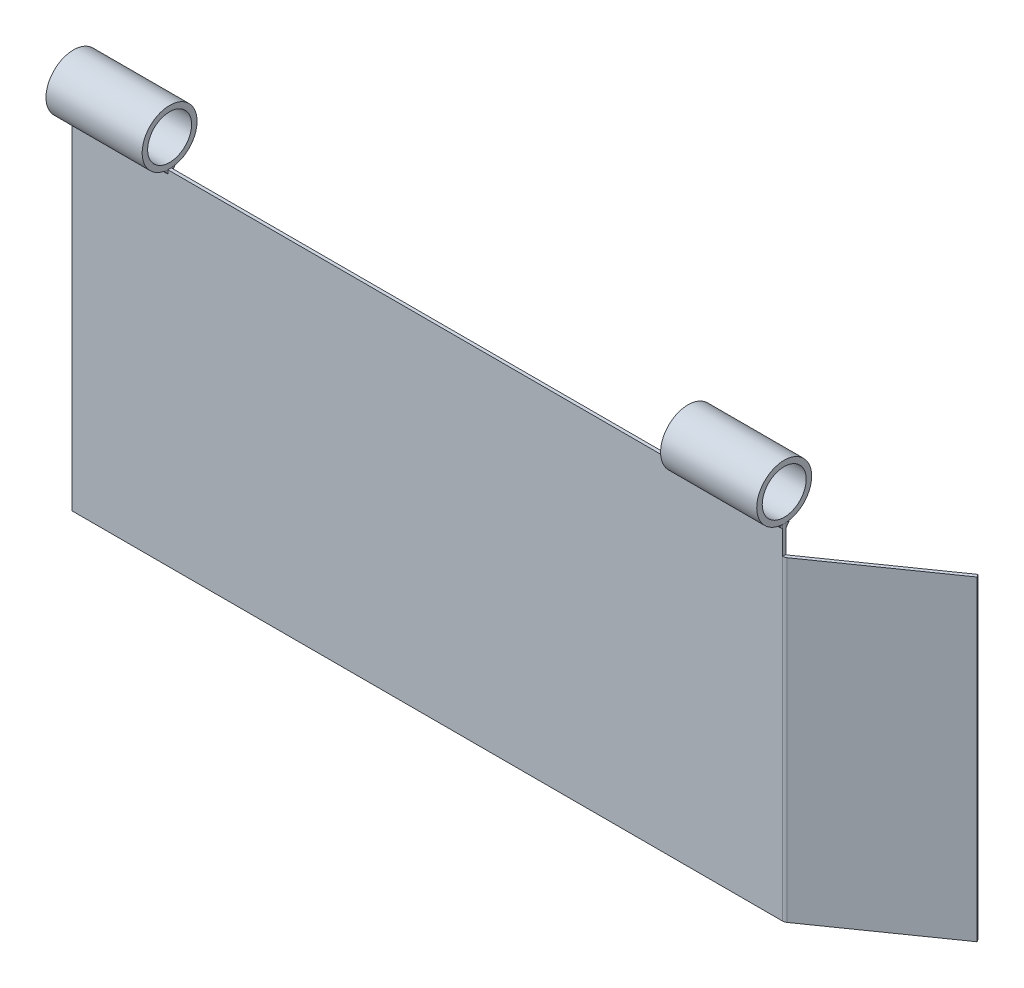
ISO-10303-21;
HEADER;
FILE_DESCRIPTION(('STEP AP214'),'2;1');
FILE_NAME('part.step','',(''),(''),'','','');
FILE_SCHEMA(('AUTOMOTIVE_DESIGN { 1 0 10303 214 1 1 1 1 }'));
ENDSEC;
DATA;
#1=APPLICATION_CONTEXT('core data for automotive mechanical design processes');
#2=APPLICATION_PROTOCOL_DEFINITION('international standard','automotive_design',2000,#1);
#3=PRODUCT_CONTEXT('',#1,'mechanical');
#4=PRODUCT('Part','Part','',(#3));
#5=PRODUCT_RELATED_PRODUCT_CATEGORY('part','',(#4));
#6=PRODUCT_DEFINITION_FORMATION('','',#4);
#7=PRODUCT_DEFINITION_CONTEXT('part definition',#1,'design');
#8=PRODUCT_DEFINITION('design','',#6,#7);
#9=PRODUCT_DEFINITION_SHAPE('','',#8);
#10=(LENGTH_UNIT() NAMED_UNIT(*) SI_UNIT(.MILLI.,.METRE.));
#11=(NAMED_UNIT(*) PLANE_ANGLE_UNIT() SI_UNIT($,.RADIAN.));
#12=(NAMED_UNIT(*) SI_UNIT($,.STERADIAN.) SOLID_ANGLE_UNIT());
#13=UNCERTAINTY_MEASURE_WITH_UNIT(LENGTH_MEASURE(1.E-05),#10,'distance_accuracy_value','');
#14=(GEOMETRIC_REPRESENTATION_CONTEXT(3) GLOBAL_UNCERTAINTY_ASSIGNED_CONTEXT((#13)) GLOBAL_UNIT_ASSIGNED_CONTEXT((#10,
#11,#12)) REPRESENTATION_CONTEXT('',''));
#15=CARTESIAN_POINT('',(0.,0.,0.));
#16=DIRECTION('',(0.,0.,1.));
#17=DIRECTION('',(1.,0.,0.));
#18=AXIS2_PLACEMENT_3D('',#15,#16,#17);
#19=CARTESIAN_POINT('',(-149.9987999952,-135.,-0.6));
#20=DIRECTION('',(0.,0.,1.));
#21=DIRECTION('',(1.,0.,0.));
#22=AXIS2_PLACEMENT_3D('',#19,#20,#21);
#23=PLANE('',#22);
#24=DIRECTION('',(0.,1.,0.));
#25=VECTOR('',#24,1.);
#26=CARTESIAN_POINT('',(-114.9987999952,-135.,-0.6));
#27=LINE('',#26,#25);
#28=CARTESIAN_POINT('',(-114.9987999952,-11.7932447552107,-0.6));
#29=VERTEX_POINT('',#28);
#30=CARTESIAN_POINT('',(-114.9987999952,-10.,-0.6));
#31=VERTEX_POINT('',#30);
#32=EDGE_CURVE('E110',#29,#31,#27,.T.);
#33=ORIENTED_EDGE('',*,*,#32,.T.);
#34=DIRECTION('',(-1.,0.,0.));
#35=VECTOR('',#34,1.);
#36=CARTESIAN_POINT('',(-149.9987999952,-10.,-0.6));
#37=LINE('',#36,#35);
#38=CARTESIAN_POINT('',(-149.9987999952,-10.,-0.6));
#39=VERTEX_POINT('',#38);
#40=EDGE_CURVE('E101',#31,#39,#37,.T.);
#41=ORIENTED_EDGE('',*,*,#40,.T.);
#42=DIRECTION('',(0.,1.,0.));
#43=VECTOR('',#42,1.);
#44=CARTESIAN_POINT('',(-149.9987999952,-135.,-0.6));
#45=LINE('',#44,#43);
#46=CARTESIAN_POINT('',(-149.9987999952,-11.7932447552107,-0.6));
#47=VERTEX_POINT('',#46);
#48=EDGE_CURVE('E114',#47,#39,#45,.T.);
#49=ORIENTED_EDGE('',*,*,#48,.F.);
#50=DIRECTION('',(1.,0.,0.));
#51=VECTOR('',#50,1.);
#52=CARTESIAN_POINT('',(-149.9987999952,-11.7932447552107,-0.6));
#53=LINE('',#52,#51);
#54=EDGE_CURVE('E52',#47,#29,#53,.T.);
#55=ORIENTED_EDGE('',*,*,#54,.T.);
#56=EDGE_LOOP('',(#33,#41,#49,#55));
#57=FACE_BOUND('',#56,.T.);
#58=ADVANCED_FACE('F49',(#57),#23,.T.);
#59=CARTESIAN_POINT('',(-114.9987999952,-8.,0.));
#60=DIRECTION('',(1.,0.,0.));
#61=DIRECTION('',(0.,0.,-1.));
#62=AXIS2_PLACEMENT_3D('',#59,#60,#61);
#63=PLANE('',#62);
#64=CARTESIAN_POINT('',(-114.9987999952,0.,0.));
#65=DIRECTION('',(1.,0.,0.));
#66=DIRECTION('',(0.,0.,-1.));
#67=AXIS2_PLACEMENT_3D('',#64,#65,#66);
#68=CIRCLE('',#67,10.);
#69=CARTESIAN_POINT('',(-114.9987999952,-9.80245261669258,-1.97785810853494));
#70=VERTEX_POINT('',#69);
#71=CARTESIAN_POINT('',(-114.9987999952,-10.,0.));
#72=VERTEX_POINT('',#71);
#73=EDGE_CURVE('E87',#70,#72,#68,.F.);
#74=ORIENTED_EDGE('',*,*,#73,.T.);
#75=DIRECTION('',(0.,0.,1.));
#76=VECTOR('',#75,1.);
#77=CARTESIAN_POINT('',(-114.9987999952,-10.,0.));
#78=LINE('',#77,#76);
#79=EDGE_CURVE('E58',#31,#72,#78,.T.);
#80=ORIENTED_EDGE('',*,*,#79,.F.);
#81=ORIENTED_EDGE('',*,*,#32,.F.);
#82=DIRECTION('',(0.,0.822266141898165,-0.569103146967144));
#83=VECTOR('',#82,1.);
#84=CARTESIAN_POINT('',(-114.9987999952,-9.80245261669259,-1.97785810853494));
#85=LINE('',#84,#83);
#86=EDGE_CURVE('E66',#29,#70,#85,.T.);
#87=ORIENTED_EDGE('',*,*,#86,.T.);
#88=EDGE_LOOP('',(#74,#80,#81,#87));
#89=FACE_BOUND('',#88,.T.);
#90=ADVANCED_FACE('F89',(#89),#63,.T.);
#91=CARTESIAN_POINT('',(-220.065090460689,-9.80245261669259,-1.97785810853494));
#92=DIRECTION('',(0.,0.569103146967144,0.822266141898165));
#93=DIRECTION('',(0.,-0.822266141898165,0.569103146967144));
#94=AXIS2_PLACEMENT_3D('',#91,#92,#93);
#95=PLANE('',#94);
#96=ORIENTED_EDGE('',*,*,#86,.F.);
#97=ORIENTED_EDGE('',*,*,#54,.F.);
#98=DIRECTION('',(0.,-0.822266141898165,0.569103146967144));
#99=VECTOR('',#98,1.);
#100=CARTESIAN_POINT('',(-149.9987999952,-9.80245261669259,-1.97785810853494));
#101=LINE('',#100,#99);
#102=CARTESIAN_POINT('',(-149.9987999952,-9.80245261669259,-1.97785810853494));
#103=VERTEX_POINT('',#102);
#104=EDGE_CURVE('E118',#103,#47,#101,.T.);
#105=ORIENTED_EDGE('',*,*,#104,.F.);
#106=DIRECTION('',(-1.,0.,0.));
#107=VECTOR('',#106,1.);
#108=CARTESIAN_POINT('',(-220.065090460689,-9.80245261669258,-1.97785810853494));
#109=LINE('',#108,#107);
#110=EDGE_CURVE('E106',#70,#103,#109,.T.);
#111=ORIENTED_EDGE('',*,*,#110,.F.);
#112=EDGE_LOOP('',(#96,#97,#105,#111));
#113=FACE_BOUND('',#112,.T.);
#114=ADVANCED_FACE('F117',(#113),#95,.F.);
#115=CARTESIAN_POINT('',(-149.9987999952,-8.,0.));
#116=DIRECTION('',(-1.,0.,0.));
#117=DIRECTION('',(0.,0.,1.));
#118=AXIS2_PLACEMENT_3D('',#115,#116,#117);
#119=PLANE('',#118);
#120=CARTESIAN_POINT('',(-149.9987999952,0.,0.));
#121=DIRECTION('',(-1.,0.,0.));
#122=DIRECTION('',(0.,0.,1.));
#123=AXIS2_PLACEMENT_3D('',#120,#121,#122);
#124=CIRCLE('',#123,10.);
#125=CARTESIAN_POINT('',(-149.9987999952,-10.,0.));
#126=VERTEX_POINT('',#125);
#127=EDGE_CURVE('E104',#103,#126,#124,.T.);
#128=ORIENTED_EDGE('',*,*,#127,.F.);
#129=ORIENTED_EDGE('',*,*,#104,.T.);
#130=ORIENTED_EDGE('',*,*,#48,.T.);
#131=DIRECTION('',(0.,0.,-1.));
#132=VECTOR('',#131,1.);
#133=CARTESIAN_POINT('',(-149.9987999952,-10.,0.601));
#134=LINE('',#133,#132);
#135=EDGE_CURVE('E13',#126,#39,#134,.T.);
#136=ORIENTED_EDGE('',*,*,#135,.F.);
#137=EDGE_LOOP('',(#128,#129,#130,#136));
#138=FACE_BOUND('',#137,.T.);
#139=ADVANCED_FACE('F123',(#138),#119,.T.);
#140=CARTESIAN_POINT('',(-220.065090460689,0.,0.));
#141=DIRECTION('',(-1.,0.,0.));
#142=DIRECTION('',(0.,0.,1.));
#143=AXIS2_PLACEMENT_3D('',#140,#141,#142);
#144=CYLINDRICAL_SURFACE('',#143,10.);
#145=ORIENTED_EDGE('',*,*,#110,.T.);
#146=ORIENTED_EDGE('',*,*,#127,.T.);
#147=DIRECTION('',(-1.,0.,0.));
#148=VECTOR('',#147,1.);
#149=CARTESIAN_POINT('',(-220.065090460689,-10.,0.));
#150=LINE('',#149,#148);
#151=EDGE_CURVE('E98',#126,#72,#150,.F.);
#152=ORIENTED_EDGE('',*,*,#151,.T.);
#153=ORIENTED_EDGE('',*,*,#73,.F.);
#154=EDGE_LOOP('',(#145,#146,#152,#153));
#155=FACE_BOUND('',#154,.T.);
#156=ADVANCED_FACE('F103',(#155),#144,.F.);
#157=CARTESIAN_POINT('',(108.728299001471,-10.,0.601));
#158=DIRECTION('',(0.,1.,0.));
#159=DIRECTION('',(-1.,0.,0.));
#160=AXIS2_PLACEMENT_3D('',#157,#158,#159);
#161=PLANE('',#160);
#162=ORIENTED_EDGE('',*,*,#79,.T.);
#163=ORIENTED_EDGE('',*,*,#151,.F.);
#164=ORIENTED_EDGE('',*,*,#135,.T.);
#165=ORIENTED_EDGE('',*,*,#40,.F.);
#166=EDGE_LOOP('',(#162,#163,#164,#165));
#167=FACE_BOUND('',#166,.T.);
#168=ADVANCED_FACE('F97',(#167),#161,.F.);
#169=CLOSED_SHELL('',(#58,#90,#114,#139,#156,#168));
#170=MANIFOLD_SOLID_BREP('B2',#169);
#171=CARTESIAN_POINT('',(-149.9987999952,-135.,0.6));
#172=DIRECTION('',(0.,0.,1.));
#173=DIRECTION('',(1.,0.,0.));
#174=AXIS2_PLACEMENT_3D('',#171,#172,#173);
#175=PLANE('',#174);
#176=DIRECTION('',(1.,0.,0.));
#177=VECTOR('',#176,1.);
#178=CARTESIAN_POINT('',(108.728299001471,-10.,0.6));
#179=LINE('',#178,#177);
#180=CARTESIAN_POINT('',(-149.9987999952,-10.,0.6));
#181=VERTEX_POINT('',#180);
#182=CARTESIAN_POINT('',(-114.9987999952,-10.,0.6));
#183=VERTEX_POINT('',#182);
#184=EDGE_CURVE('E260',#181,#183,#179,.T.);
#185=ORIENTED_EDGE('',*,*,#184,.T.);
#186=DIRECTION('',(0.,1.,0.));
#187=VECTOR('',#186,1.);
#188=CARTESIAN_POINT('',(-114.9987999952,-135.,0.6));
#189=LINE('',#188,#187);
#190=CARTESIAN_POINT('',(-114.9987999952,-11.3835825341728,0.6));
#191=VERTEX_POINT('',#190);
#192=EDGE_CURVE('E47',#191,#183,#189,.T.);
#193=ORIENTED_EDGE('',*,*,#192,.F.);
#194=DIRECTION('',(-1.,0.,0.));
#195=VECTOR('',#194,1.);
#196=CARTESIAN_POINT('',(-149.9987999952,-11.3835825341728,0.6));
#197=LINE('',#196,#195);
#198=CARTESIAN_POINT('',(-149.9987999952,-11.3835825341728,0.6));
#199=VERTEX_POINT('',#198);
#200=EDGE_CURVE('E194',#191,#199,#197,.T.);
#201=ORIENTED_EDGE('',*,*,#200,.T.);
#202=DIRECTION('',(0.,1.,0.));
#203=VECTOR('',#202,1.);
#204=CARTESIAN_POINT('',(-149.9987999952,-8.,0.6));
#205=LINE('',#204,#203);
#206=EDGE_CURVE('E242',#199,#181,#205,.T.);
#207=ORIENTED_EDGE('',*,*,#206,.T.);
#208=EDGE_LOOP('',(#185,#193,#201,#207));
#209=FACE_BOUND('',#208,.T.);
#210=ADVANCED_FACE('F191',(#209),#175,.F.);
#211=CARTESIAN_POINT('',(-114.9987999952,-8.,0.));
#212=DIRECTION('',(1.,0.,0.));
#213=DIRECTION('',(0.,0.,-1.));
#214=AXIS2_PLACEMENT_3D('',#211,#212,#213);
#215=PLANE('',#214);
#216=DIRECTION('',(0.,-0.771089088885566,-0.63672727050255));
#217=VECTOR('',#216,1.);
#218=CARTESIAN_POINT('',(-114.9987999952,-11.3835825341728,0.6));
#219=LINE('',#218,#217);
#220=CARTESIAN_POINT('',(-114.9987999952,-9.81946901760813,1.89156765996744));
#221=VERTEX_POINT('',#220);
#222=EDGE_CURVE('E245',#221,#191,#219,.T.);
#223=ORIENTED_EDGE('',*,*,#222,.T.);
#224=ORIENTED_EDGE('',*,*,#192,.T.);
#225=DIRECTION('',(0.,0.,1.));
#226=VECTOR('',#225,1.);
#227=CARTESIAN_POINT('',(-114.9987999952,-10.,0.));
#228=LINE('',#227,#226);
#229=CARTESIAN_POINT('',(-114.9987999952,-10.,0.));
#230=VERTEX_POINT('',#229);
#231=EDGE_CURVE('E248',#230,#183,#228,.T.);
#232=ORIENTED_EDGE('',*,*,#231,.F.);
#233=CARTESIAN_POINT('',(-114.9987999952,0.,0.));
#234=DIRECTION('',(1.,0.,0.));
#235=DIRECTION('',(0.,0.,-1.));
#236=AXIS2_PLACEMENT_3D('',#233,#234,#235);
#237=CIRCLE('',#236,10.);
#238=EDGE_CURVE('E255',#230,#221,#237,.F.);
#239=ORIENTED_EDGE('',*,*,#238,.T.);
#240=EDGE_LOOP('',(#223,#224,#232,#239));
#241=FACE_BOUND('',#240,.T.);
#242=ADVANCED_FACE('F265',(#241),#215,.T.);
#243=CARTESIAN_POINT('',(-220.065090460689,-11.3835825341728,0.6));
#244=DIRECTION('',(0.,0.63672727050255,-0.771089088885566));
#245=DIRECTION('',(0.,0.771089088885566,0.63672727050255));
#246=AXIS2_PLACEMENT_3D('',#243,#244,#245);
#247=PLANE('',#246);
#248=ORIENTED_EDGE('',*,*,#200,.F.);
#249=ORIENTED_EDGE('',*,*,#222,.F.);
#250=DIRECTION('',(-1.,0.,0.));
#251=VECTOR('',#250,1.);
#252=CARTESIAN_POINT('',(-220.065090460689,-9.81946901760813,1.89156765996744));
#253=LINE('',#252,#251);
#254=CARTESIAN_POINT('',(-149.9987999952,-9.81946901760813,1.89156765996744));
#255=VERTEX_POINT('',#254);
#256=EDGE_CURVE('E231',#255,#221,#253,.F.);
#257=ORIENTED_EDGE('',*,*,#256,.F.);
#258=DIRECTION('',(0.,0.771089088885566,0.63672727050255));
#259=VECTOR('',#258,1.);
#260=CARTESIAN_POINT('',(-149.9987999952,-11.3835825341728,0.6));
#261=LINE('',#260,#259);
#262=EDGE_CURVE('E237',#199,#255,#261,.T.);
#263=ORIENTED_EDGE('',*,*,#262,.F.);
#264=EDGE_LOOP('',(#248,#249,#257,#263));
#265=FACE_BOUND('',#264,.T.);
#266=ADVANCED_FACE('F247',(#265),#247,.F.);
#267=CARTESIAN_POINT('',(-149.9987999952,-8.,0.));
#268=DIRECTION('',(-1.,0.,0.));
#269=DIRECTION('',(0.,0.,1.));
#270=AXIS2_PLACEMENT_3D('',#267,#268,#269);
#271=PLANE('',#270);
#272=ORIENTED_EDGE('',*,*,#262,.T.);
#273=CARTESIAN_POINT('',(-149.9987999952,0.,0.));
#274=DIRECTION('',(-1.,0.,0.));
#275=DIRECTION('',(0.,0.,1.));
#276=AXIS2_PLACEMENT_3D('',#273,#274,#275);
#277=CIRCLE('',#276,10.);
#278=CARTESIAN_POINT('',(-149.9987999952,-10.,0.));
#279=VERTEX_POINT('',#278);
#280=EDGE_CURVE('E227',#255,#279,#277,.F.);
#281=ORIENTED_EDGE('',*,*,#280,.T.);
#282=DIRECTION('',(0.,0.,-1.));
#283=VECTOR('',#282,1.);
#284=CARTESIAN_POINT('',(-149.9987999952,-10.,0.601));
#285=LINE('',#284,#283);
#286=EDGE_CURVE('E251',#181,#279,#285,.T.);
#287=ORIENTED_EDGE('',*,*,#286,.F.);
#288=ORIENTED_EDGE('',*,*,#206,.F.);
#289=EDGE_LOOP('',(#272,#281,#287,#288));
#290=FACE_BOUND('',#289,.T.);
#291=ADVANCED_FACE('F241',(#290),#271,.T.);
#292=CARTESIAN_POINT('',(-220.065090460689,0.,0.));
#293=DIRECTION('',(-1.,0.,0.));
#294=DIRECTION('',(0.,0.,1.));
#295=AXIS2_PLACEMENT_3D('',#292,#293,#294);
#296=CYLINDRICAL_SURFACE('',#295,10.);
#297=ORIENTED_EDGE('',*,*,#238,.F.);
#298=DIRECTION('',(-1.,0.,0.));
#299=VECTOR('',#298,1.);
#300=CARTESIAN_POINT('',(-220.065090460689,-10.,0.));
#301=LINE('',#300,#299);
#302=EDGE_CURVE('E200',#279,#230,#301,.F.);
#303=ORIENTED_EDGE('',*,*,#302,.F.);
#304=ORIENTED_EDGE('',*,*,#280,.F.);
#305=ORIENTED_EDGE('',*,*,#256,.T.);
#306=EDGE_LOOP('',(#297,#303,#304,#305));
#307=FACE_BOUND('',#306,.T.);
#308=ADVANCED_FACE('F229',(#307),#296,.F.);
#309=CARTESIAN_POINT('',(108.728299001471,-10.,0.601));
#310=DIRECTION('',(0.,1.,0.));
#311=DIRECTION('',(-1.,0.,0.));
#312=AXIS2_PLACEMENT_3D('',#309,#310,#311);
#313=PLANE('',#312);
#314=ORIENTED_EDGE('',*,*,#231,.T.);
#315=ORIENTED_EDGE('',*,*,#184,.F.);
#316=ORIENTED_EDGE('',*,*,#286,.T.);
#317=ORIENTED_EDGE('',*,*,#302,.T.);
#318=EDGE_LOOP('',(#314,#315,#316,#317));
#319=FACE_BOUND('',#318,.T.);
#320=ADVANCED_FACE('F264',(#319),#313,.F.);
#321=CLOSED_SHELL('',(#210,#242,#266,#291,#308,#320));
#322=MANIFOLD_SOLID_BREP('B7',#321);
#323=CARTESIAN_POINT('',(108.728299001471,-20.,0.601));
#324=DIRECTION('',(1.,0.,0.));
#325=DIRECTION('',(0.,0.,-1.));
#326=AXIS2_PLACEMENT_3D('',#323,#324,#325);
#327=PLANE('',#326);
#328=DIRECTION('',(0.,0.,-1.));
#329=VECTOR('',#328,1.);
#330=CARTESIAN_POINT('',(108.728299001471,-10.,0.601));
#331=LINE('',#330,#329);
#332=CARTESIAN_POINT('',(108.728299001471,-10.,-0.6));
#333=VERTEX_POINT('',#332);
#334=CARTESIAN_POINT('',(108.728299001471,-10.,-1.84113250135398));
#335=VERTEX_POINT('',#334);
#336=EDGE_CURVE('E355',#333,#335,#331,.T.);
#337=ORIENTED_EDGE('',*,*,#336,.F.);
#338=DIRECTION('',(0.,1.,0.));
#339=VECTOR('',#338,1.);
#340=CARTESIAN_POINT('',(108.728299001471,-135.,-0.6));
#341=LINE('',#340,#339);
#342=CARTESIAN_POINT('',(108.728299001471,-11.7932447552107,-0.6));
#343=VERTEX_POINT('',#342);
#344=EDGE_CURVE('E386',#343,#333,#341,.T.);
#345=ORIENTED_EDGE('',*,*,#344,.F.);
#346=DIRECTION('',(0.,0.822266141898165,-0.569103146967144));
#347=VECTOR('',#346,1.);
#348=CARTESIAN_POINT('',(108.728299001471,-9.80245261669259,-1.97785810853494));
#349=LINE('',#348,#347);
#350=EDGE_CURVE('E380',#343,#335,#349,.T.);
#351=ORIENTED_EDGE('',*,*,#350,.T.);
#352=EDGE_LOOP('',(#337,#345,#351));
#353=FACE_BOUND('',#352,.T.);
#354=ADVANCED_FACE('F333',(#353),#327,.T.);
#355=CARTESIAN_POINT('',(-220.065090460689,-9.80245261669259,-1.97785810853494));
#356=DIRECTION('',(0.,0.569103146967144,0.822266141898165));
#357=DIRECTION('',(0.,-0.822266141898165,0.569103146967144));
#358=AXIS2_PLACEMENT_3D('',#355,#356,#357);
#359=PLANE('',#358);
#360=DIRECTION('',(1.,0.,0.));
#361=VECTOR('',#360,1.);
#362=CARTESIAN_POINT('',(-149.9987999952,-11.7932447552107,-0.6));
#363=LINE('',#362,#361);
#364=CARTESIAN_POINT('',(73.7282990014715,-11.7932447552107,-0.6));
#365=VERTEX_POINT('',#364);
#366=EDGE_CURVE('E375',#365,#343,#363,.T.);
#367=ORIENTED_EDGE('',*,*,#366,.F.);
#368=DIRECTION('',(0.,0.822266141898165,-0.569103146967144));
#369=VECTOR('',#368,1.);
#370=CARTESIAN_POINT('',(73.7282990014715,-9.80245261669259,-1.97785810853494));
#371=LINE('',#370,#369);
#372=CARTESIAN_POINT('',(73.7282990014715,-10.,-1.84113250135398));
#373=VERTEX_POINT('',#372);
#374=EDGE_CURVE('E189',#365,#373,#371,.T.);
#375=ORIENTED_EDGE('',*,*,#374,.T.);
#376=DIRECTION('',(-1.,0.,0.));
#377=VECTOR('',#376,1.);
#378=CARTESIAN_POINT('',(-220.065090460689,-10.,-1.84113250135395));
#379=LINE('',#378,#377);
#380=EDGE_CURVE('E341',#335,#373,#379,.T.);
#381=ORIENTED_EDGE('',*,*,#380,.F.);
#382=ORIENTED_EDGE('',*,*,#350,.F.);
#383=EDGE_LOOP('',(#367,#375,#381,#382));
#384=FACE_BOUND('',#383,.T.);
#385=ADVANCED_FACE('F335',(#384),#359,.F.);
#386=CARTESIAN_POINT('',(108.728299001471,-10.,0.601));
#387=DIRECTION('',(0.,1.,0.));
#388=DIRECTION('',(-1.,0.,0.));
#389=AXIS2_PLACEMENT_3D('',#386,#387,#388);
#390=PLANE('',#389);
#391=DIRECTION('',(0.,0.,-1.));
#392=VECTOR('',#391,1.);
#393=CARTESIAN_POINT('',(73.7282990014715,-10.,0.601));
#394=LINE('',#393,#392);
#395=CARTESIAN_POINT('',(73.7282990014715,-10.,-0.6));
#396=VERTEX_POINT('',#395);
#397=EDGE_CURVE('E348',#396,#373,#394,.T.);
#398=ORIENTED_EDGE('',*,*,#397,.F.);
#399=DIRECTION('',(-1.,0.,0.));
#400=VECTOR('',#399,1.);
#401=CARTESIAN_POINT('',(-149.9987999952,-10.,-0.6));
#402=LINE('',#401,#400);
#403=EDGE_CURVE('E377',#333,#396,#402,.T.);
#404=ORIENTED_EDGE('',*,*,#403,.F.);
#405=ORIENTED_EDGE('',*,*,#336,.T.);
#406=ORIENTED_EDGE('',*,*,#380,.T.);
#407=EDGE_LOOP('',(#398,#404,#405,#406));
#408=FACE_BOUND('',#407,.T.);
#409=ADVANCED_FACE('F385',(#408),#390,.T.);
#410=CARTESIAN_POINT('',(-149.9987999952,-135.,-0.6));
#411=DIRECTION('',(0.,0.,1.));
#412=DIRECTION('',(1.,0.,0.));
#413=AXIS2_PLACEMENT_3D('',#410,#411,#412);
#414=PLANE('',#413);
#415=DIRECTION('',(0.,1.,0.));
#416=VECTOR('',#415,1.);
#417=CARTESIAN_POINT('',(73.7282990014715,-135.,-0.6));
#418=LINE('',#417,#416);
#419=EDGE_CURVE('E368',#365,#396,#418,.T.);
#420=ORIENTED_EDGE('',*,*,#419,.F.);
#421=ORIENTED_EDGE('',*,*,#366,.T.);
#422=ORIENTED_EDGE('',*,*,#344,.T.);
#423=ORIENTED_EDGE('',*,*,#403,.T.);
#424=EDGE_LOOP('',(#420,#421,#422,#423));
#425=FACE_BOUND('',#424,.T.);
#426=ADVANCED_FACE('F374',(#425),#414,.T.);
#427=CARTESIAN_POINT('',(73.7282990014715,-135.,-13.8826637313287));
#428=DIRECTION('',(1.,0.,0.));
#429=DIRECTION('',(0.,0.,-1.));
#430=AXIS2_PLACEMENT_3D('',#427,#428,#429);
#431=PLANE('',#430);
#432=ORIENTED_EDGE('',*,*,#397,.T.);
#433=ORIENTED_EDGE('',*,*,#374,.F.);
#434=ORIENTED_EDGE('',*,*,#419,.T.);
#435=EDGE_LOOP('',(#432,#433,#434));
#436=FACE_BOUND('',#435,.T.);
#437=ADVANCED_FACE('F367',(#436),#431,.F.);
#438=CLOSED_SHELL('',(#354,#385,#409,#426,#437));
#439=MANIFOLD_SOLID_BREP('B41',#438);
#440=CARTESIAN_POINT('',(108.728299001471,-20.,0.601));
#441=DIRECTION('',(1.,0.,0.));
#442=DIRECTION('',(0.,0.,-1.));
#443=AXIS2_PLACEMENT_3D('',#440,#441,#442);
#444=PLANE('',#443);
#445=DIRECTION('',(0.,1.,0.));
#446=VECTOR('',#445,1.);
#447=CARTESIAN_POINT('',(108.728299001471,-20.,0.599999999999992));
#448=LINE('',#447,#446);
#449=CARTESIAN_POINT('',(108.728299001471,-11.3835825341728,0.599999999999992));
#450=VERTEX_POINT('',#449);
#451=CARTESIAN_POINT('',(108.728299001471,-10.,0.599999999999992));
#452=VERTEX_POINT('',#451);
#453=EDGE_CURVE('E485',#450,#452,#448,.T.);
#454=ORIENTED_EDGE('',*,*,#453,.T.);
#455=DIRECTION('',(0.,0.,-1.));
#456=VECTOR('',#455,1.);
#457=CARTESIAN_POINT('',(108.728299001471,-10.,0.601));
#458=LINE('',#457,#456);
#459=CARTESIAN_POINT('',(108.728299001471,-10.,1.74249409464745));
#460=VERTEX_POINT('',#459);
#461=EDGE_CURVE('E484',#460,#452,#458,.T.);
#462=ORIENTED_EDGE('',*,*,#461,.F.);
#463=DIRECTION('',(0.,-0.771089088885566,-0.63672727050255));
#464=VECTOR('',#463,1.);
#465=CARTESIAN_POINT('',(108.728299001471,-11.3835825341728,0.6));
#466=LINE('',#465,#464);
#467=EDGE_CURVE('E446',#460,#450,#466,.T.);
#468=ORIENTED_EDGE('',*,*,#467,.T.);
#469=EDGE_LOOP('',(#454,#462,#468));
#470=FACE_BOUND('',#469,.T.);
#471=ADVANCED_FACE('F438',(#470),#444,.T.);
#472=CARTESIAN_POINT('',(-220.065090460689,-11.3835825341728,0.6));
#473=DIRECTION('',(0.,0.63672727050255,-0.771089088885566));
#474=DIRECTION('',(0.,0.771089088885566,0.63672727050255));
#475=AXIS2_PLACEMENT_3D('',#472,#473,#474);
#476=PLANE('',#475);
#477=DIRECTION('',(1.,0.,0.));
#478=VECTOR('',#477,1.);
#479=CARTESIAN_POINT('',(-220.065090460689,-10.,1.74249409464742));
#480=LINE('',#479,#478);
#481=CARTESIAN_POINT('',(73.7282990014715,-10.,1.74249409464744));
#482=VERTEX_POINT('',#481);
#483=EDGE_CURVE('E460',#482,#460,#480,.T.);
#484=ORIENTED_EDGE('',*,*,#483,.F.);
#485=DIRECTION('',(0.,-0.771089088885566,-0.63672727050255));
#486=VECTOR('',#485,1.);
#487=CARTESIAN_POINT('',(73.7282990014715,-11.3835825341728,0.6));
#488=LINE('',#487,#486);
#489=CARTESIAN_POINT('',(73.7282990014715,-11.3835825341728,0.6));
#490=VERTEX_POINT('',#489);
#491=EDGE_CURVE('E331',#482,#490,#488,.T.);
#492=ORIENTED_EDGE('',*,*,#491,.T.);
#493=DIRECTION('',(-1.,0.,0.));
#494=VECTOR('',#493,1.);
#495=CARTESIAN_POINT('',(-149.9987999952,-11.3835825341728,0.6));
#496=LINE('',#495,#494);
#497=EDGE_CURVE('E481',#450,#490,#496,.T.);
#498=ORIENTED_EDGE('',*,*,#497,.F.);
#499=ORIENTED_EDGE('',*,*,#467,.F.);
#500=EDGE_LOOP('',(#484,#492,#498,#499));
#501=FACE_BOUND('',#500,.T.);
#502=ADVANCED_FACE('F440',(#501),#476,.F.);
#503=CARTESIAN_POINT('',(108.728299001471,-10.,0.601));
#504=DIRECTION('',(0.,1.,0.));
#505=DIRECTION('',(-1.,0.,0.));
#506=AXIS2_PLACEMENT_3D('',#503,#504,#505);
#507=PLANE('',#506);
#508=DIRECTION('',(0.,0.,-1.));
#509=VECTOR('',#508,1.);
#510=CARTESIAN_POINT('',(73.7282990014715,-10.,0.601));
#511=LINE('',#510,#509);
#512=CARTESIAN_POINT('',(73.7282990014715,-10.,0.6));
#513=VERTEX_POINT('',#512);
#514=EDGE_CURVE('E471',#482,#513,#511,.T.);
#515=ORIENTED_EDGE('',*,*,#514,.F.);
#516=ORIENTED_EDGE('',*,*,#483,.T.);
#517=ORIENTED_EDGE('',*,*,#461,.T.);
#518=DIRECTION('',(1.,0.,0.));
#519=VECTOR('',#518,1.);
#520=CARTESIAN_POINT('',(108.728299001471,-10.,0.6));
#521=LINE('',#520,#519);
#522=EDGE_CURVE('E474',#513,#452,#521,.T.);
#523=ORIENTED_EDGE('',*,*,#522,.F.);
#524=EDGE_LOOP('',(#515,#516,#517,#523));
#525=FACE_BOUND('',#524,.T.);
#526=ADVANCED_FACE('F483',(#525),#507,.T.);
#527=CARTESIAN_POINT('',(-149.9987999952,-135.,0.6));
#528=DIRECTION('',(0.,0.,1.));
#529=DIRECTION('',(1.,0.,0.));
#530=AXIS2_PLACEMENT_3D('',#527,#528,#529);
#531=PLANE('',#530);
#532=ORIENTED_EDGE('',*,*,#497,.T.);
#533=DIRECTION('',(0.,1.,0.));
#534=VECTOR('',#533,1.);
#535=CARTESIAN_POINT('',(73.7282990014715,-135.,0.6));
#536=LINE('',#535,#534);
#537=EDGE_CURVE('E453',#490,#513,#536,.T.);
#538=ORIENTED_EDGE('',*,*,#537,.T.);
#539=ORIENTED_EDGE('',*,*,#522,.T.);
#540=ORIENTED_EDGE('',*,*,#453,.F.);
#541=EDGE_LOOP('',(#532,#538,#539,#540));
#542=FACE_BOUND('',#541,.T.);
#543=ADVANCED_FACE('F478',(#542),#531,.F.);
#544=CARTESIAN_POINT('',(73.7282990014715,-135.,0.6));
#545=DIRECTION('',(1.,0.,0.));
#546=DIRECTION('',(0.,0.,-1.));
#547=AXIS2_PLACEMENT_3D('',#544,#545,#546);
#548=PLANE('',#547);
#549=ORIENTED_EDGE('',*,*,#514,.T.);
#550=ORIENTED_EDGE('',*,*,#537,.F.);
#551=ORIENTED_EDGE('',*,*,#491,.F.);
#552=EDGE_LOOP('',(#549,#550,#551));
#553=FACE_BOUND('',#552,.T.);
#554=ADVANCED_FACE('F472',(#553),#548,.F.);
#555=CLOSED_SHELL('',(#471,#502,#526,#543,#554));
#556=MANIFOLD_SOLID_BREP('B183',#555);
#557=CARTESIAN_POINT('',(73.7282990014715,-8.,0.));
#558=DIRECTION('',(-1.,0.,0.));
#559=DIRECTION('',(0.,0.,1.));
#560=AXIS2_PLACEMENT_3D('',#557,#558,#559);
#561=PLANE('',#560);
#562=CARTESIAN_POINT('',(73.7282990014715,0.,0.));
#563=DIRECTION('',(-1.,0.,0.));
#564=DIRECTION('',(0.,0.,1.));
#565=AXIS2_PLACEMENT_3D('',#562,#563,#564);
#566=CIRCLE('',#565,10.);
#567=CARTESIAN_POINT('',(73.7282990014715,0.,10.));
#568=VERTEX_POINT('',#567);
#569=EDGE_CURVE('E437',#568,#568,#566,.T.);
#570=ORIENTED_EDGE('',*,*,#569,.T.);
#571=EDGE_LOOP('',(#570));
#572=FACE_BOUND('',#571,.T.);
#573=CARTESIAN_POINT('',(73.7282990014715,0.,0.));
#574=DIRECTION('',(-1.,0.,0.));
#575=DIRECTION('',(0.,0.,1.));
#576=AXIS2_PLACEMENT_3D('',#573,#574,#575);
#577=CIRCLE('',#576,8.);
#578=CARTESIAN_POINT('',(73.7282990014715,0.,8.));
#579=VERTEX_POINT('',#578);
#580=EDGE_CURVE('E557',#579,#579,#577,.T.);
#581=ORIENTED_EDGE('',*,*,#580,.F.);
#582=EDGE_LOOP('',(#581));
#583=FACE_BOUND('',#582,.T.);
#584=ADVANCED_FACE('F543',(#572,#583),#561,.T.);
#585=CARTESIAN_POINT('',(-220.065090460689,0.,0.));
#586=DIRECTION('',(-1.,0.,0.));
#587=DIRECTION('',(0.,0.,1.));
#588=AXIS2_PLACEMENT_3D('',#585,#586,#587);
#589=CYLINDRICAL_SURFACE('',#588,10.);
#590=CARTESIAN_POINT('',(108.728299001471,0.,0.));
#591=DIRECTION('',(-1.,0.,0.));
#592=DIRECTION('',(0.,0.,1.));
#593=AXIS2_PLACEMENT_3D('',#590,#591,#592);
#594=CIRCLE('',#593,10.);
#595=CARTESIAN_POINT('',(108.728299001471,0.,10.));
#596=VERTEX_POINT('',#595);
#597=EDGE_CURVE('E549',#596,#596,#594,.T.);
#598=ORIENTED_EDGE('',*,*,#597,.T.);
#599=EDGE_LOOP('',(#598));
#600=FACE_BOUND('',#599,.T.);
#601=ORIENTED_EDGE('',*,*,#569,.F.);
#602=EDGE_LOOP('',(#601));
#603=FACE_BOUND('',#602,.T.);
#604=ADVANCED_FACE('F567',(#600,#603),#589,.T.);
#605=CARTESIAN_POINT('',(108.728299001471,-8.,0.));
#606=DIRECTION('',(1.,0.,0.));
#607=DIRECTION('',(0.,0.,-1.));
#608=AXIS2_PLACEMENT_3D('',#605,#606,#607);
#609=PLANE('',#608);
#610=CARTESIAN_POINT('',(108.728299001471,0.,0.));
#611=DIRECTION('',(-1.,0.,0.));
#612=DIRECTION('',(0.,0.,1.));
#613=AXIS2_PLACEMENT_3D('',#610,#611,#612);
#614=CIRCLE('',#613,8.);
#615=CARTESIAN_POINT('',(108.728299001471,0.,8.));
#616=VERTEX_POINT('',#615);
#617=EDGE_CURVE('E553',#616,#616,#614,.T.);
#618=ORIENTED_EDGE('',*,*,#617,.T.);
#619=EDGE_LOOP('',(#618));
#620=FACE_BOUND('',#619,.T.);
#621=ORIENTED_EDGE('',*,*,#597,.F.);
#622=EDGE_LOOP('',(#621));
#623=FACE_BOUND('',#622,.T.);
#624=ADVANCED_FACE('F571',(#620,#623),#609,.T.);
#625=CARTESIAN_POINT('',(-220.065090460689,0.,0.));
#626=DIRECTION('',(-1.,0.,0.));
#627=DIRECTION('',(0.,0.,1.));
#628=AXIS2_PLACEMENT_3D('',#625,#626,#627);
#629=CYLINDRICAL_SURFACE('',#628,8.);
#630=ORIENTED_EDGE('',*,*,#580,.T.);
#631=EDGE_LOOP('',(#630));
#632=FACE_BOUND('',#631,.T.);
#633=ORIENTED_EDGE('',*,*,#617,.F.);
#634=EDGE_LOOP('',(#633));
#635=FACE_BOUND('',#634,.T.);
#636=ADVANCED_FACE('F563',(#632,#635),#629,.F.);
#637=CLOSED_SHELL('',(#584,#604,#624,#636));
#638=MANIFOLD_SOLID_BREP('B325',#637);
#639=CARTESIAN_POINT('',(-149.9987999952,-8.,0.));
#640=DIRECTION('',(-1.,0.,0.));
#641=DIRECTION('',(0.,0.,1.));
#642=AXIS2_PLACEMENT_3D('',#639,#640,#641);
#643=PLANE('',#642);
#644=CARTESIAN_POINT('',(-149.9987999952,0.,0.));
#645=DIRECTION('',(-1.,0.,0.));
#646=DIRECTION('',(0.,0.,1.));
#647=AXIS2_PLACEMENT_3D('',#644,#645,#646);
#648=CIRCLE('',#647,10.);
#649=CARTESIAN_POINT('',(-149.9987999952,0.,10.));
#650=VERTEX_POINT('',#649);
#651=EDGE_CURVE('E542',#650,#650,#648,.T.);
#652=ORIENTED_EDGE('',*,*,#651,.T.);
#653=EDGE_LOOP('',(#652));
#654=FACE_BOUND('',#653,.T.);
#655=CARTESIAN_POINT('',(-149.9987999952,0.,0.));
#656=DIRECTION('',(-1.,0.,0.));
#657=DIRECTION('',(0.,0.,1.));
#658=AXIS2_PLACEMENT_3D('',#655,#656,#657);
#659=CIRCLE('',#658,8.);
#660=CARTESIAN_POINT('',(-149.9987999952,0.,8.));
#661=VERTEX_POINT('',#660);
#662=EDGE_CURVE('E627',#661,#661,#659,.T.);
#663=ORIENTED_EDGE('',*,*,#662,.F.);
#664=EDGE_LOOP('',(#663));
#665=FACE_BOUND('',#664,.T.);
#666=ADVANCED_FACE('F613',(#654,#665),#643,.T.);
#667=CARTESIAN_POINT('',(-220.065090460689,0.,0.));
#668=DIRECTION('',(-1.,0.,0.));
#669=DIRECTION('',(0.,0.,1.));
#670=AXIS2_PLACEMENT_3D('',#667,#668,#669);
#671=CYLINDRICAL_SURFACE('',#670,10.);
#672=CARTESIAN_POINT('',(-114.9987999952,0.,0.));
#673=DIRECTION('',(-1.,0.,0.));
#674=DIRECTION('',(0.,0.,1.));
#675=AXIS2_PLACEMENT_3D('',#672,#673,#674);
#676=CIRCLE('',#675,10.);
#677=CARTESIAN_POINT('',(-114.9987999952,0.,10.));
#678=VERTEX_POINT('',#677);
#679=EDGE_CURVE('E619',#678,#678,#676,.T.);
#680=ORIENTED_EDGE('',*,*,#679,.T.);
#681=EDGE_LOOP('',(#680));
#682=FACE_BOUND('',#681,.T.);
#683=ORIENTED_EDGE('',*,*,#651,.F.);
#684=EDGE_LOOP('',(#683));
#685=FACE_BOUND('',#684,.T.);
#686=ADVANCED_FACE('F637',(#682,#685),#671,.T.);
#687=CARTESIAN_POINT('',(-114.9987999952,-8.,0.));
#688=DIRECTION('',(1.,0.,0.));
#689=DIRECTION('',(0.,0.,-1.));
#690=AXIS2_PLACEMENT_3D('',#687,#688,#689);
#691=PLANE('',#690);
#692=CARTESIAN_POINT('',(-114.9987999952,0.,0.));
#693=DIRECTION('',(-1.,0.,0.));
#694=DIRECTION('',(0.,0.,1.));
#695=AXIS2_PLACEMENT_3D('',#692,#693,#694);
#696=CIRCLE('',#695,8.);
#697=CARTESIAN_POINT('',(-114.9987999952,0.,8.));
#698=VERTEX_POINT('',#697);
#699=EDGE_CURVE('E623',#698,#698,#696,.T.);
#700=ORIENTED_EDGE('',*,*,#699,.T.);
#701=EDGE_LOOP('',(#700));
#702=FACE_BOUND('',#701,.T.);
#703=ORIENTED_EDGE('',*,*,#679,.F.);
#704=EDGE_LOOP('',(#703));
#705=FACE_BOUND('',#704,.T.);
#706=ADVANCED_FACE('F641',(#702,#705),#691,.T.);
#707=CARTESIAN_POINT('',(-220.065090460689,0.,0.));
#708=DIRECTION('',(-1.,0.,0.));
#709=DIRECTION('',(0.,0.,1.));
#710=AXIS2_PLACEMENT_3D('',#707,#708,#709);
#711=CYLINDRICAL_SURFACE('',#710,8.);
#712=ORIENTED_EDGE('',*,*,#662,.T.);
#713=EDGE_LOOP('',(#712));
#714=FACE_BOUND('',#713,.T.);
#715=ORIENTED_EDGE('',*,*,#699,.F.);
#716=EDGE_LOOP('',(#715));
#717=FACE_BOUND('',#716,.T.);
#718=ADVANCED_FACE('F633',(#714,#717),#711,.F.);
#719=CLOSED_SHELL('',(#666,#686,#706,#718));
#720=MANIFOLD_SOLID_BREP('B432',#719);
#721=CARTESIAN_POINT('',(109.731889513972,-135.,0.382982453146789));
#722=DIRECTION('',(0.573576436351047,0.,0.819152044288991));
#723=DIRECTION('',(0.819152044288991,0.,-0.573576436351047));
#724=AXIS2_PLACEMENT_3D('',#721,#722,#723);
#725=PLANE('',#724);
#726=DIRECTION('',(0.,1.,0.));
#727=VECTOR('',#726,1.);
#728=CARTESIAN_POINT('',(150.689491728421,-135.,-28.2958393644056));
#729=LINE('',#728,#727);
#730=CARTESIAN_POINT('',(150.689491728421,-135.,-28.2958393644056));
#731=VERTEX_POINT('',#730);
#732=CARTESIAN_POINT('',(150.689491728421,-20.,-28.2958393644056));
#733=VERTEX_POINT('',#732);
#734=EDGE_CURVE('E785',#731,#733,#729,.T.);
#735=ORIENTED_EDGE('',*,*,#734,.T.);
#736=DIRECTION('',(0.819152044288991,0.,-0.573576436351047));
#737=VECTOR('',#736,1.);
#738=CARTESIAN_POINT('',(137.112418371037,-20.,-18.7890702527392));
#739=LINE('',#738,#737);
#740=CARTESIAN_POINT('',(109.990167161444,-20.,0.20213449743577));
#741=VERTEX_POINT('',#740);
#742=EDGE_CURVE('E689',#741,#733,#739,.T.);
#743=ORIENTED_EDGE('',*,*,#742,.F.);
#744=DIRECTION('',(0.,1.,0.));
#745=VECTOR('',#744,1.);
#746=CARTESIAN_POINT('',(109.990167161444,-135.,0.20213449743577));
#747=LINE('',#746,#745);
#748=CARTESIAN_POINT('',(109.990167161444,-135.,0.20213449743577));
#749=VERTEX_POINT('',#748);
#750=EDGE_CURVE('E788',#749,#741,#747,.T.);
#751=ORIENTED_EDGE('',*,*,#750,.F.);
#752=DIRECTION('',(0.819152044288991,0.,-0.573576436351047));
#753=VECTOR('',#752,1.);
#754=CARTESIAN_POINT('',(109.731889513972,-135.,0.382982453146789));
#755=LINE('',#754,#753);
#756=EDGE_CURVE('E765',#749,#731,#755,.T.);
#757=ORIENTED_EDGE('',*,*,#756,.T.);
#758=EDGE_LOOP('',(#735,#743,#751,#757));
#759=FACE_BOUND('',#758,.T.);
#760=ADVANCED_FACE('F674',(#759),#725,.T.);
#761=CARTESIAN_POINT('',(108.728299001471,-135.,-1.60000000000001));
#762=DIRECTION('',(0.,1.,0.));
#763=DIRECTION('',(0.,0.,1.));
#764=AXIS2_PLACEMENT_3D('',#761,#762,#763);
#765=CYLINDRICAL_SURFACE('',#764,2.2);
#766=ORIENTED_EDGE('',*,*,#750,.T.);
#767=CARTESIAN_POINT('',(108.728299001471,-20.,-1.60000000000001));
#768=DIRECTION('',(0.,1.,0.));
#769=DIRECTION('',(-1.,0.,0.));
#770=AXIS2_PLACEMENT_3D('',#767,#768,#769);
#771=CIRCLE('',#770,2.2);
#772=CARTESIAN_POINT('',(108.728299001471,-20.,0.599999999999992));
#773=VERTEX_POINT('',#772);
#774=EDGE_CURVE('E816',#773,#741,#771,.T.);
#775=ORIENTED_EDGE('',*,*,#774,.F.);
#776=DIRECTION('',(0.,1.,0.));
#777=VECTOR('',#776,1.);
#778=CARTESIAN_POINT('',(108.728299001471,-135.,0.599999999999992));
#779=LINE('',#778,#777);
#780=CARTESIAN_POINT('',(108.728299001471,-135.,0.599999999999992));
#781=VERTEX_POINT('',#780);
#782=EDGE_CURVE('E773',#781,#773,#779,.T.);
#783=ORIENTED_EDGE('',*,*,#782,.F.);
#784=CARTESIAN_POINT('',(108.728299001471,-135.,-1.60000000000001));
#785=DIRECTION('',(0.,1.,0.));
#786=DIRECTION('',(1.,0.,0.));
#787=AXIS2_PLACEMENT_3D('',#784,#785,#786);
#788=CIRCLE('',#787,2.2);
#789=EDGE_CURVE('E787',#781,#749,#788,.T.);
#790=ORIENTED_EDGE('',*,*,#789,.T.);
#791=EDGE_LOOP('',(#766,#775,#783,#790));
#792=FACE_BOUND('',#791,.T.);
#793=ADVANCED_FACE('F846',(#792),#765,.T.);
#794=CARTESIAN_POINT('',(-149.9987999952,-135.,0.6));
#795=DIRECTION('',(0.,0.,1.));
#796=DIRECTION('',(1.,0.,0.));
#797=AXIS2_PLACEMENT_3D('',#794,#795,#796);
#798=PLANE('',#797);
#799=DIRECTION('',(0.,1.,0.));
#800=VECTOR('',#799,1.);
#801=CARTESIAN_POINT('',(108.728299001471,-135.,0.599999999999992));
#802=LINE('',#801,#800);
#803=CARTESIAN_POINT('',(108.728299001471,-10.,0.599999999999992));
#804=VERTEX_POINT('',#803);
#805=EDGE_CURVE('E821',#773,#804,#802,.T.);
#806=ORIENTED_EDGE('',*,*,#805,.T.);
#807=DIRECTION('',(1.,0.,0.));
#808=VECTOR('',#807,1.);
#809=CARTESIAN_POINT('',(108.728299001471,-10.,0.6));
#810=LINE('',#809,#808);
#811=CARTESIAN_POINT('',(-149.9987999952,-10.,0.6));
#812=VERTEX_POINT('',#811);
#813=EDGE_CURVE('E818',#812,#804,#810,.T.);
#814=ORIENTED_EDGE('',*,*,#813,.F.);
#815=DIRECTION('',(0.,1.,0.));
#816=VECTOR('',#815,1.);
#817=CARTESIAN_POINT('',(-149.9987999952,-135.,0.6));
#818=LINE('',#817,#816);
#819=CARTESIAN_POINT('',(-149.9987999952,-135.,0.6));
#820=VERTEX_POINT('',#819);
#821=EDGE_CURVE('E764',#820,#812,#818,.T.);
#822=ORIENTED_EDGE('',*,*,#821,.F.);
#823=DIRECTION('',(1.,0.,0.));
#824=VECTOR('',#823,1.);
#825=CARTESIAN_POINT('',(-149.9987999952,-135.,0.6));
#826=LINE('',#825,#824);
#827=EDGE_CURVE('E799',#820,#781,#826,.T.);
#828=ORIENTED_EDGE('',*,*,#827,.T.);
#829=ORIENTED_EDGE('',*,*,#782,.T.);
#830=EDGE_LOOP('',(#806,#814,#822,#828,#829));
#831=FACE_BOUND('',#830,.T.);
#832=ADVANCED_FACE('F844',(#831),#798,.T.);
#833=CARTESIAN_POINT('',(-149.9987999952,-135.,0.6));
#834=DIRECTION('',(1.,0.,0.));
#835=DIRECTION('',(0.,0.,-1.));
#836=AXIS2_PLACEMENT_3D('',#833,#834,#835);
#837=PLANE('',#836);
#838=DIRECTION('',(0.,0.,-1.));
#839=VECTOR('',#838,1.);
#840=CARTESIAN_POINT('',(-149.9987999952,-10.,0.601));
#841=LINE('',#840,#839);
#842=CARTESIAN_POINT('',(-149.9987999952,-10.,-0.600000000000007));
#843=VERTEX_POINT('',#842);
#844=EDGE_CURVE('E746',#812,#843,#841,.T.);
#845=ORIENTED_EDGE('',*,*,#844,.T.);
#846=DIRECTION('',(0.,1.,0.));
#847=VECTOR('',#846,1.);
#848=CARTESIAN_POINT('',(-149.9987999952,-135.,-0.6));
#849=LINE('',#848,#847);
#850=CARTESIAN_POINT('',(-149.9987999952,-135.,-0.6));
#851=VERTEX_POINT('',#850);
#852=EDGE_CURVE('E762',#851,#843,#849,.T.);
#853=ORIENTED_EDGE('',*,*,#852,.F.);
#854=DIRECTION('',(0.,0.,-1.));
#855=VECTOR('',#854,1.);
#856=CARTESIAN_POINT('',(-149.9987999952,-135.,0.6));
#857=LINE('',#856,#855);
#858=EDGE_CURVE('E802',#820,#851,#857,.T.);
#859=ORIENTED_EDGE('',*,*,#858,.F.);
#860=ORIENTED_EDGE('',*,*,#821,.T.);
#861=EDGE_LOOP('',(#845,#853,#859,#860));
#862=FACE_BOUND('',#861,.T.);
#863=ADVANCED_FACE('F760',(#862),#837,.F.);
#864=CARTESIAN_POINT('',(-149.9987999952,-135.,-0.6));
#865=DIRECTION('',(0.,0.,1.));
#866=DIRECTION('',(1.,0.,0.));
#867=AXIS2_PLACEMENT_3D('',#864,#865,#866);
#868=PLANE('',#867);
#869=DIRECTION('',(-1.,0.,0.));
#870=VECTOR('',#869,1.);
#871=CARTESIAN_POINT('',(108.728299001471,-10.,-0.6));
#872=LINE('',#871,#870);
#873=CARTESIAN_POINT('',(108.728299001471,-10.,-0.600000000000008));
#874=VERTEX_POINT('',#873);
#875=EDGE_CURVE('E743',#874,#843,#872,.T.);
#876=ORIENTED_EDGE('',*,*,#875,.F.);
#877=DIRECTION('',(0.,1.,0.));
#878=VECTOR('',#877,1.);
#879=CARTESIAN_POINT('',(108.728299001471,-135.,-0.6));
#880=LINE('',#879,#878);
#881=CARTESIAN_POINT('',(108.728299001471,-20.,-0.600000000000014));
#882=VERTEX_POINT('',#881);
#883=EDGE_CURVE('E829',#882,#874,#880,.T.);
#884=ORIENTED_EDGE('',*,*,#883,.F.);
#885=DIRECTION('',(0.,1.,0.));
#886=VECTOR('',#885,1.);
#887=CARTESIAN_POINT('',(108.728299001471,-135.,-0.6));
#888=LINE('',#887,#886);
#889=CARTESIAN_POINT('',(108.728299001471,-135.,-0.6));
#890=VERTEX_POINT('',#889);
#891=EDGE_CURVE('E771',#890,#882,#888,.T.);
#892=ORIENTED_EDGE('',*,*,#891,.F.);
#893=DIRECTION('',(1.,0.,0.));
#894=VECTOR('',#893,1.);
#895=CARTESIAN_POINT('',(-149.9987999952,-135.,-0.6));
#896=LINE('',#895,#894);
#897=EDGE_CURVE('E770',#851,#890,#896,.T.);
#898=ORIENTED_EDGE('',*,*,#897,.F.);
#899=ORIENTED_EDGE('',*,*,#852,.T.);
#900=EDGE_LOOP('',(#876,#884,#892,#898,#899));
#901=FACE_BOUND('',#900,.T.);
#902=ADVANCED_FACE('F767',(#901),#868,.F.);
#903=CARTESIAN_POINT('',(108.728299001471,-135.,-1.60000000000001));
#904=DIRECTION('',(0.,1.,0.));
#905=DIRECTION('',(0.,0.,1.));
#906=AXIS2_PLACEMENT_3D('',#903,#904,#905);
#907=CYLINDRICAL_SURFACE('',#906,1.);
#908=CARTESIAN_POINT('',(108.728299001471,-20.,-1.60000000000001));
#909=DIRECTION('',(0.,-1.,0.));
#910=DIRECTION('',(1.,0.,0.));
#911=AXIS2_PLACEMENT_3D('',#908,#909,#910);
#912=CIRCLE('',#911,1.);
#913=CARTESIAN_POINT('',(109.301875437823,-20.,-0.780847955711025));
#914=VERTEX_POINT('',#913);
#915=EDGE_CURVE('E755',#914,#882,#912,.T.);
#916=ORIENTED_EDGE('',*,*,#915,.F.);
#917=DIRECTION('',(0.,1.,0.));
#918=VECTOR('',#917,1.);
#919=CARTESIAN_POINT('',(109.301875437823,-135.,-0.780847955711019));
#920=LINE('',#919,#918);
#921=CARTESIAN_POINT('',(109.301875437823,-135.,-0.780847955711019));
#922=VERTEX_POINT('',#921);
#923=EDGE_CURVE('E776',#922,#914,#920,.T.);
#924=ORIENTED_EDGE('',*,*,#923,.F.);
#925=CARTESIAN_POINT('',(108.728299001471,-135.,-1.60000000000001));
#926=DIRECTION('',(0.,-1.,0.));
#927=DIRECTION('',(0.,0.,-1.));
#928=AXIS2_PLACEMENT_3D('',#925,#926,#927);
#929=CIRCLE('',#928,1.);
#930=EDGE_CURVE('E805',#890,#922,#929,.F.);
#931=ORIENTED_EDGE('',*,*,#930,.F.);
#932=ORIENTED_EDGE('',*,*,#891,.T.);
#933=EDGE_LOOP('',(#916,#924,#931,#932));
#934=FACE_BOUND('',#933,.T.);
#935=ADVANCED_FACE('F836',(#934),#907,.F.);
#936=CARTESIAN_POINT('',(109.04359779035,-135.,-0.6));
#937=DIRECTION('',(0.573576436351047,0.,0.819152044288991));
#938=DIRECTION('',(0.819152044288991,0.,-0.573576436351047));
#939=AXIS2_PLACEMENT_3D('',#936,#937,#938);
#940=PLANE('',#939);
#941=DIRECTION('',(-0.819152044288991,0.,0.573576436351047));
#942=VECTOR('',#941,1.);
#943=CARTESIAN_POINT('',(150.463520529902,-20.,-29.6025421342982));
#944=LINE('',#943,#942);
#945=CARTESIAN_POINT('',(150.0012000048,-20.,-29.2788218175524));
#946=VERTEX_POINT('',#945);
#947=EDGE_CURVE('E824',#946,#914,#944,.T.);
#948=ORIENTED_EDGE('',*,*,#947,.F.);
#949=DIRECTION('',(0.,1.,0.));
#950=VECTOR('',#949,1.);
#951=CARTESIAN_POINT('',(150.0012000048,-135.,-29.2788218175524));
#952=LINE('',#951,#950);
#953=CARTESIAN_POINT('',(150.0012000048,-135.,-29.2788218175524));
#954=VERTEX_POINT('',#953);
#955=EDGE_CURVE('E782',#954,#946,#952,.T.);
#956=ORIENTED_EDGE('',*,*,#955,.F.);
#957=DIRECTION('',(0.819152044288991,0.,-0.573576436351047));
#958=VECTOR('',#957,1.);
#959=CARTESIAN_POINT('',(109.04359779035,-135.,-0.6));
#960=LINE('',#959,#958);
#961=EDGE_CURVE('E807',#922,#954,#960,.T.);
#962=ORIENTED_EDGE('',*,*,#961,.F.);
#963=ORIENTED_EDGE('',*,*,#923,.T.);
#964=EDGE_LOOP('',(#948,#956,#962,#963));
#965=FACE_BOUND('',#964,.T.);
#966=ADVANCED_FACE('F866',(#965),#940,.F.);
#967=CARTESIAN_POINT('',(150.0012000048,-135.,-29.2788218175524));
#968=DIRECTION('',(-0.819152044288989,0.,0.57357643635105));
#969=DIRECTION('',(0.57357643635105,0.,0.819152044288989));
#970=AXIS2_PLACEMENT_3D('',#967,#968,#969);
#971=PLANE('',#970);
#972=DIRECTION('',(-0.57357643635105,0.,-0.819152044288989));
#973=VECTOR('',#972,1.);
#974=CARTESIAN_POINT('',(150.227171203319,-20.,-28.9561015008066));
#975=LINE('',#974,#973);
#976=EDGE_CURVE('E754',#733,#946,#975,.T.);
#977=ORIENTED_EDGE('',*,*,#976,.F.);
#978=ORIENTED_EDGE('',*,*,#734,.F.);
#979=DIRECTION('',(0.57357643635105,0.,0.819152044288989));
#980=VECTOR('',#979,1.);
#981=CARTESIAN_POINT('',(150.0012000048,-135.,-29.2788218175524));
#982=LINE('',#981,#980);
#983=EDGE_CURVE('E809',#954,#731,#982,.T.);
#984=ORIENTED_EDGE('',*,*,#983,.F.);
#985=ORIENTED_EDGE('',*,*,#955,.T.);
#986=EDGE_LOOP('',(#977,#978,#984,#985));
#987=FACE_BOUND('',#986,.T.);
#988=ADVANCED_FACE('F869',(#987),#971,.F.);
#989=CARTESIAN_POINT('',(108.728299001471,-135.,-0.6));
#990=DIRECTION('',(0.,-1.,0.));
#991=DIRECTION('',(0.,0.,-1.));
#992=AXIS2_PLACEMENT_3D('',#989,#990,#991);
#993=PLANE('',#992);
#994=DIRECTION('',(0.,0.,1.));
#995=VECTOR('',#994,1.);
#996=CARTESIAN_POINT('',(108.728299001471,-135.,-0.6));
#997=LINE('',#996,#995);
#998=EDGE_CURVE('E611',#890,#781,#997,.T.);
#999=ORIENTED_EDGE('',*,*,#998,.F.);
#1000=ORIENTED_EDGE('',*,*,#930,.T.);
#1001=DIRECTION('',(-0.573576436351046,0.,-0.819152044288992));
#1002=VECTOR('',#1001,1.);
#1003=CARTESIAN_POINT('',(109.990167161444,-135.,0.20213449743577));
#1004=LINE('',#1003,#1002);
#1005=EDGE_CURVE('E682',#749,#922,#1004,.T.);
#1006=ORIENTED_EDGE('',*,*,#1005,.F.);
#1007=ORIENTED_EDGE('',*,*,#789,.F.);
#1008=EDGE_LOOP('',(#999,#1000,#1006,#1007));
#1009=FACE_BOUND('',#1008,.T.);
#1010=ADVANCED_FACE('F676',(#1009),#993,.T.);
#1011=CARTESIAN_POINT('',(109.990167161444,-135.,0.20213449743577));
#1012=DIRECTION('',(0.,-1.,0.));
#1013=DIRECTION('',(0.,0.,-1.));
#1014=AXIS2_PLACEMENT_3D('',#1011,#1012,#1013);
#1015=PLANE('',#1014);
#1016=ORIENTED_EDGE('',*,*,#897,.T.);
#1017=ORIENTED_EDGE('',*,*,#998,.T.);
#1018=ORIENTED_EDGE('',*,*,#827,.F.);
#1019=ORIENTED_EDGE('',*,*,#858,.T.);
#1020=EDGE_LOOP('',(#1016,#1017,#1018,#1019));
#1021=FACE_BOUND('',#1020,.T.);
#1022=ADVANCED_FACE('F842',(#1021),#1015,.T.);
#1023=CARTESIAN_POINT('',(108.728299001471,-135.,-1.60000000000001));
#1024=DIRECTION('',(0.,-1.,0.));
#1025=DIRECTION('',(0.,0.,-1.));
#1026=AXIS2_PLACEMENT_3D('',#1023,#1024,#1025);
#1027=PLANE('',#1026);
#1028=ORIENTED_EDGE('',*,*,#756,.F.);
#1029=ORIENTED_EDGE('',*,*,#1005,.T.);
#1030=ORIENTED_EDGE('',*,*,#961,.T.);
#1031=ORIENTED_EDGE('',*,*,#983,.T.);
#1032=EDGE_LOOP('',(#1028,#1029,#1030,#1031));
#1033=FACE_BOUND('',#1032,.T.);
#1034=ADVANCED_FACE('F857',(#1033),#1027,.T.);
#1035=CARTESIAN_POINT('',(108.728299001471,-10.,0.601));
#1036=DIRECTION('',(0.,1.,0.));
#1037=DIRECTION('',(-1.,0.,0.));
#1038=AXIS2_PLACEMENT_3D('',#1035,#1036,#1037);
#1039=PLANE('',#1038);
#1040=ORIENTED_EDGE('',*,*,#813,.T.);
#1041=DIRECTION('',(0.,0.,-1.));
#1042=VECTOR('',#1041,1.);
#1043=CARTESIAN_POINT('',(108.728299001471,-10.,0.601));
#1044=LINE('',#1043,#1042);
#1045=EDGE_CURVE('E749',#804,#874,#1044,.T.);
#1046=ORIENTED_EDGE('',*,*,#1045,.T.);
#1047=ORIENTED_EDGE('',*,*,#875,.T.);
#1048=ORIENTED_EDGE('',*,*,#844,.F.);
#1049=EDGE_LOOP('',(#1040,#1046,#1047,#1048));
#1050=FACE_BOUND('',#1049,.T.);
#1051=ADVANCED_FACE('F745',(#1050),#1039,.T.);
#1052=CARTESIAN_POINT('',(108.728299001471,-20.,0.601));
#1053=DIRECTION('',(1.,0.,0.));
#1054=DIRECTION('',(0.,0.,-1.));
#1055=AXIS2_PLACEMENT_3D('',#1052,#1053,#1054);
#1056=PLANE('',#1055);
#1057=ORIENTED_EDGE('',*,*,#805,.F.);
#1058=DIRECTION('',(0.,0.,-1.));
#1059=VECTOR('',#1058,1.);
#1060=CARTESIAN_POINT('',(108.728299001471,-20.,0.601));
#1061=LINE('',#1060,#1059);
#1062=EDGE_CURVE('E814',#773,#882,#1061,.T.);
#1063=ORIENTED_EDGE('',*,*,#1062,.T.);
#1064=ORIENTED_EDGE('',*,*,#883,.T.);
#1065=ORIENTED_EDGE('',*,*,#1045,.F.);
#1066=EDGE_LOOP('',(#1057,#1063,#1064,#1065));
#1067=FACE_BOUND('',#1066,.T.);
#1068=ADVANCED_FACE('F831',(#1067),#1056,.T.);
#1069=CARTESIAN_POINT('',(150.689491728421,-20.,0.601));
#1070=DIRECTION('',(0.,1.,0.));
#1071=DIRECTION('',(-1.,0.,0.));
#1072=AXIS2_PLACEMENT_3D('',#1069,#1070,#1071);
#1073=PLANE('',#1072);
#1074=ORIENTED_EDGE('',*,*,#742,.T.);
#1075=ORIENTED_EDGE('',*,*,#976,.T.);
#1076=ORIENTED_EDGE('',*,*,#947,.T.);
#1077=ORIENTED_EDGE('',*,*,#915,.T.);
#1078=ORIENTED_EDGE('',*,*,#1062,.F.);
#1079=ORIENTED_EDGE('',*,*,#774,.T.);
#1080=EDGE_LOOP('',(#1074,#1075,#1076,#1077,#1078,#1079));
#1081=FACE_BOUND('',#1080,.T.);
#1082=ADVANCED_FACE('F845',(#1081),#1073,.T.);
#1083=CLOSED_SHELL('',(#760,#793,#832,#863,#902,#935,#966,#988,#1010,#1022,#1034,#1051,#1068,#1082));
#1084=MANIFOLD_SOLID_BREP('B537',#1083);
#1085=ADVANCED_BREP_SHAPE_REPRESENTATION('',(#18,#170,#322,#439,#556,#638,#720,#1084),#14);
#1086=SHAPE_DEFINITION_REPRESENTATION(#9,#1085);
ENDSEC;
END-ISO-10303-21;
